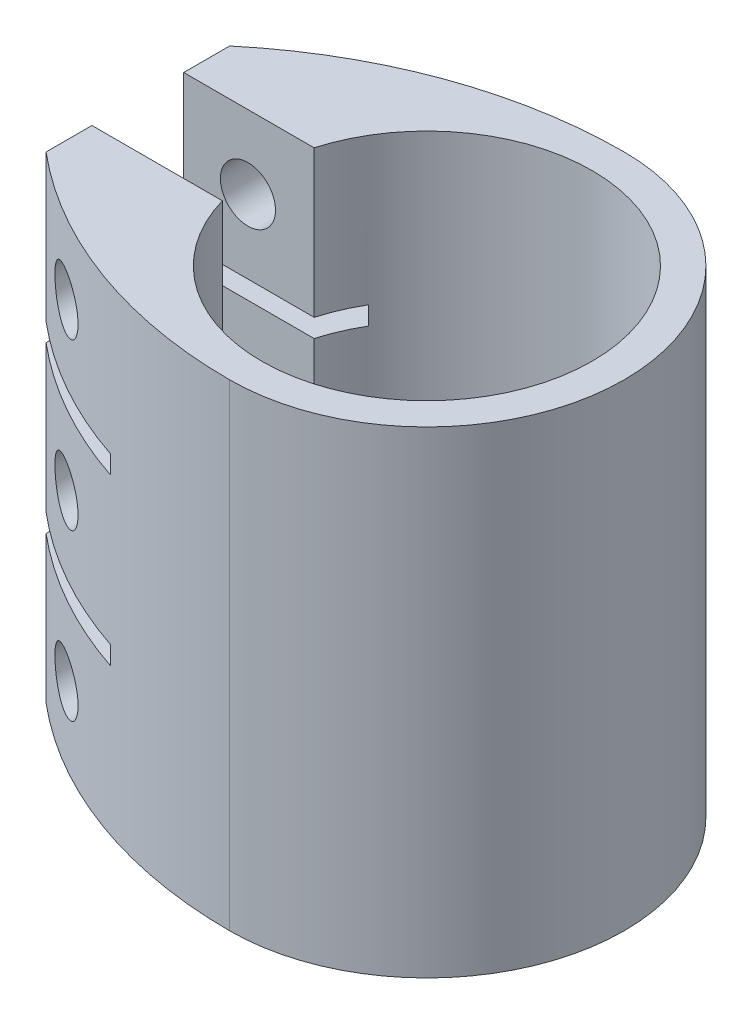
from build123d import *

# Parameters (mm, degrees)
SALIENTE_EXTRUIR1_DEPTH    = 52
CORTAR_EXTRUIR1_DEPTH      = 52
CORTAR_EXTRUIR1_DEPTH_BACK = 52
CROQUIS2_W                 = 16
CROQUIS2_H                 = 2
CORTAR_EXTRUIR2_DEPTH      = 52
CORTAR_EXTRUIR2_DEPTH_BACK = 52
CROQUIS3_R                 = 3


with BuildPart() as part:
    # Croquis1 → Saliente-Extruir1 (new body)
    with BuildSketch(Plane(origin=(0, 0, 0), x_dir=(1, 0, 0), z_dir=(0, 1, 0))):
        with BuildLine():
            Line((-31.5, 10), (-31.5, 5))
            Line((-31.5, 5), (-17.291616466, 5))
            ThreePointArc((-17.291616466, 5), (18, 0), (-17.291616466, -5))
            Line((-17.291616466, -5), (-31.5, -5))
            Line((-31.5, -5), (-31.5, -10))
            ThreePointArc((-31.5, -10), (-16.766782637, -18.535100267), (0, -21.5))
            ThreePointArc((0, -21.5), (21.5, 0), (0, 21.5))
            ThreePointArc((0, 21.5), (-16.766782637, 18.535100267), (-31.5, 10))
        make_face()
    extrude(amount=SALIENTE_EXTRUIR1_DEPTH)

    # Croquis2 → Cortar-Extruir1 (cut, two sides: drawn at the far end of the back side and taken through both)
    with BuildSketch(Plane.XY.offset(-CORTAR_EXTRUIR1_DEPTH_BACK)):
        with Locations((-23.5, 17)):
            Rectangle(CROQUIS2_W, CROQUIS2_H)
        with Locations((-23.5, 35)):
            Rectangle(CROQUIS2_W, CROQUIS2_H)
    extrude(amount=CORTAR_EXTRUIR1_DEPTH + CORTAR_EXTRUIR1_DEPTH_BACK, mode=Mode.SUBTRACT)

    # Croquis3 → Cortar-Extruir2 (cut, two sides: drawn at the far end of the back side and taken through both)
    with BuildSketch(Plane.XY.offset(-5).offset(-CORTAR_EXTRUIR2_DEPTH_BACK)):
        with Locations(Location((-24.5, 44, 0), (0, 0, 180))):
            Circle(CROQUIS3_R)
        with Locations(Location((-24.5, 26, 0), (0, 0, 180))):
            Circle(CROQUIS3_R)
        with Locations(Location((-24.5, 8, 0), (0, 0, 180))):
            Circle(CROQUIS3_R)
    extrude(amount=CORTAR_EXTRUIR2_DEPTH + CORTAR_EXTRUIR2_DEPTH_BACK, mode=Mode.SUBTRACT)


solid = part.part
